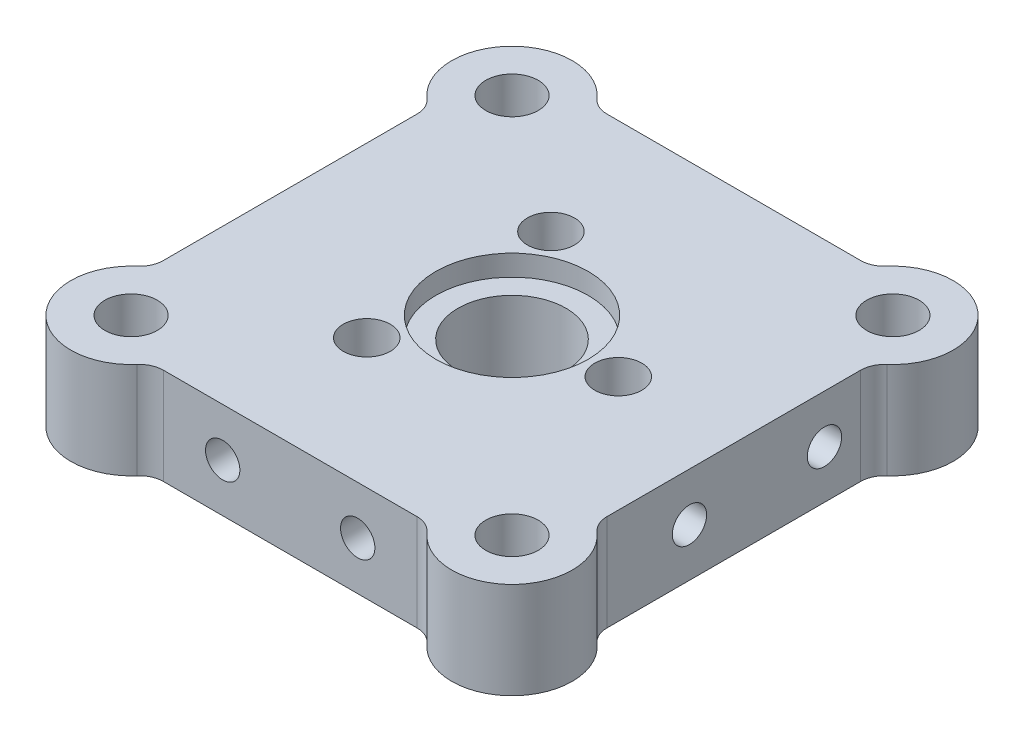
from build123d import *
from build123d.topology import SkipClean

# Parameters (mm, degrees)
SKETCH1_W                        = 33.02
SKETCH1_H                        = 33.02
EXTRUDE1_DEPTH                   = 6.35
SKETCH3_R                        = 5.0165
CUT_EXTRUDE2_DEPTH               = 1.3716
CUT_EXTRUDE3_REACH               = 25.874
SKETCH4_R                        = 3.556
FILLET1_R                        = 3.96875
CUT_EXTRUDE4_DEPTH               = 25.196749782
CBORE_FOR_M2_5_SHCS1_D           = 3.1
CBORE_FOR_M2_5_SHCS1_CBORE_D     = 5.5
CBORE_FOR_M2_5_SHCS1_CBORE_DEPTH = 3.516
F_4_40_TAPPED_HOLE1_D            = 2.2606
F_4_40_TAPPED_HOLE1_DEPTH        = 7.5946
F_4_40_TAPPED_HOLE1_TIP          = 0.679152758
F_4_40_TAPPED_HOLE2_D            = 2.2606
F_4_40_TAPPED_HOLE2_DEPTH        = 7.5946
F_4_40_TAPPED_HOLE2_TIP          = 0.679152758
F_8_32_TAPPED_HOLE1_D            = 3.4544
F_4_40_TAPPED_HOLE3_D            = 2.2606
F_4_40_TAPPED_HOLE3_DEPTH        = 7.5946
F_4_40_TAPPED_HOLE3_TIP          = 0.679152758
F_4_40_TAPPED_HOLE4_D            = 2.2606
F_4_40_TAPPED_HOLE4_DEPTH        = 7.5946
F_4_40_TAPPED_HOLE4_TIP          = 0.679152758


with BuildPart() as part:
    # Sketch1 → Extrude1 (new body)
    with BuildSketch(Plane(origin=(0, 0, 0), x_dir=(0, 0, -1), z_dir=(0, 1, 0))):
        Rectangle(SKETCH1_W, SKETCH1_H)
    extrude(amount=EXTRUDE1_DEPTH)

    # Sketch3 → Cut-Extrude2 (cut)
    with BuildSketch(Plane(origin=(0, 6.35, 0), x_dir=(1, 0, 0), z_dir=(0, 1, 0))):
        with Locations(Location((0, 0, 0), (0, 0, 270))):
            Circle(SKETCH3_R)
    extrude(amount=-CUT_EXTRUDE2_DEPTH, mode=Mode.SUBTRACT)

    # Sketch4 → Cut-Extrude3 (cut, up to next)
    with BuildSketch(Plane(origin=(0, 4.9784, 0), x_dir=(1, 0, 0), z_dir=(0, 1, 0)), mode=Mode.PRIVATE) as cut_extrude3_sk1:
        with Locations(Location((0, 0, 0), (0, 0, 180))):
            Circle(SKETCH4_R)
    cut_extrude3_tool1 = extrude(cut_extrude3_sk1.sketch, amount=-CUT_EXTRUDE3_REACH, mode=Mode.PRIVATE) & part.part
    add(cut_extrude3_tool1.solids().sort_by_distance((0, 4.9784, 0))[0], mode=Mode.SUBTRACT)

    # Fillet1
    fillet1_edges = [part.edges().sort_by_distance(p)[0] for p in [
        (16.51, 3.175, -16.51),
        (16.51, 3.175, 16.51),
        (-16.51, 3.175, 16.51),
        (-16.51, 3.175, -16.51),
    ]]
    fillet(fillet1_edges, radius=FILLET1_R)

    # Sketch21 → Cut-Extrude4 (cut, through all)
    with SkipClean():  # the faces are left unmerged after this step: merging them gives an invalid solid
        with BuildSketch(Plane(origin=(0, 6.35, 0), x_dir=(1, 0, 0), z_dir=(0, 1, 0))):
            with BuildLine():
                Line((16.51, -12.54125), (16.51, 12.54125))
                ThreePointArc((16.51, 12.54125), (16.153840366, 10.898031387), (15.149285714, 9.54974097))
                ThreePointArc((15.149285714, 9.54974097), (14.747463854, 9.010424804), (14.605, 8.353137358))
                Line((14.605, 8.353137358), (14.605, -8.353137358))
                ThreePointArc((14.605, -8.353137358), (14.747463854, -9.010424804), (15.149285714, -9.54974097))
                ThreePointArc((15.149285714, -9.54974097), (16.153840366, -10.898031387), (16.51, -12.54125))
            make_face()
            with BuildLine():
                Line((12.54125, 16.51), (-12.54125, 16.51))
                ThreePointArc((-12.54125, 16.51), (-10.898031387, 16.153840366), (-9.54974097, 15.149285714))
                ThreePointArc((-9.54974097, 15.149285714), (-9.010424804, 14.747463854), (-8.353137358, 14.605))
                Line((-8.353137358, 14.605), (8.353137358, 14.605))
                ThreePointArc((8.353137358, 14.605), (9.010424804, 14.747463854), (9.54974097, 15.149285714))
                ThreePointArc((9.54974097, 15.149285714), (10.898031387, 16.153840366), (12.54125, 16.51))
            make_face()
            with BuildLine():
                Line((-16.51, 12.54125), (-16.51, -12.54125))
                ThreePointArc((-16.51, -12.54125), (-16.153840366, -10.898031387), (-15.149285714, -9.54974097))
                ThreePointArc((-15.149285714, -9.54974097), (-14.747463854, -9.010424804), (-14.605, -8.353137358))
                Line((-14.605, -8.353137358), (-14.605, 8.353137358))
                ThreePointArc((-14.605, 8.353137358), (-14.747463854, 9.010424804), (-15.149285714, 9.54974097))
                ThreePointArc((-15.149285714, 9.54974097), (-16.153840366, 10.898031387), (-16.51, 12.54125))
            make_face()
            with BuildLine():
                Line((-12.54125, -16.51), (12.54125, -16.51))
                ThreePointArc((12.54125, -16.51), (10.898031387, -16.153840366), (9.54974097, -15.149285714))
                ThreePointArc((9.54974097, -15.149285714), (9.010424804, -14.747463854), (8.353137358, -14.605))
                Line((8.353137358, -14.605), (-8.353137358, -14.605))
                ThreePointArc((-8.353137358, -14.605), (-9.010424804, -14.747463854), (-9.54974097, -15.149285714))
                ThreePointArc((-9.54974097, -15.149285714), (-10.898031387, -16.153840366), (-12.54125, -16.51))
            make_face()
        extrude(amount=-CUT_EXTRUDE4_DEPTH, mode=Mode.SUBTRACT)

    # CBORE for M2.5 SHCS1 (through all)
    with Locations(Plane(origin=(3.175, 0, 0), x_dir=(-1, 0, 0), z_dir=(0, -1, 0))):
        with Locations((-3.825, 0), (6.675, -6.062177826), (6.675, 6.062177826)):
            CounterBoreHole(CBORE_FOR_M2_5_SHCS1_D / 2, CBORE_FOR_M2_5_SHCS1_CBORE_D / 2, CBORE_FOR_M2_5_SHCS1_CBORE_DEPTH)

    # 4-40 Tapped Hole1
    with Locations(Plane(origin=(-14.605, 0, 0), x_dir=(0, 0, -1), z_dir=(-1, 0, 0))):
        with Locations((-4.445, -3.175), (4.445, -3.175)):
            Hole(F_4_40_TAPPED_HOLE1_D / 2, depth=F_4_40_TAPPED_HOLE1_DEPTH)
            with Locations((0, 0, -(F_4_40_TAPPED_HOLE1_DEPTH + F_4_40_TAPPED_HOLE1_TIP / 2))):  # 118° drill point
                Cone(0, F_4_40_TAPPED_HOLE1_D / 2, F_4_40_TAPPED_HOLE1_TIP, mode=Mode.SUBTRACT)

    # 4-40 Tapped Hole2
    with Locations(Plane(origin=(0, 0, 14.605), x_dir=(-1, 0, 0), z_dir=(0, 0, 1))):
        with Locations((4.445, -3.175), (-4.445, -3.175)):
            Hole(F_4_40_TAPPED_HOLE2_D / 2, depth=F_4_40_TAPPED_HOLE2_DEPTH)
            with Locations((0, 0, -(F_4_40_TAPPED_HOLE2_DEPTH + F_4_40_TAPPED_HOLE2_TIP / 2))):  # 118° drill point
                Cone(0, F_4_40_TAPPED_HOLE2_D / 2, F_4_40_TAPPED_HOLE2_TIP, mode=Mode.SUBTRACT)

    # 8-32 Tapped Hole1 (through all)
    with Locations(Plane(origin=(0, 6.35, 0), x_dir=(1, 0, 0), z_dir=(0, 1, 0))):
        with Locations((12.54125, 12.54125), (-12.54125, 12.54125), (12.54125, -12.54125), (-12.54125, -12.54125)):
            Hole(F_8_32_TAPPED_HOLE1_D / 2)

    # 4-40 Tapped Hole3
    with Locations(Plane(origin=(0, 0, -14.605), x_dir=(-1, 0, 0), z_dir=(0, 0, -1))):
        with Locations((-5.207, 3.175), (3.683, 3.175)):
            Hole(F_4_40_TAPPED_HOLE3_D / 2, depth=F_4_40_TAPPED_HOLE3_DEPTH)
            with Locations((0, 0, -(F_4_40_TAPPED_HOLE3_DEPTH + F_4_40_TAPPED_HOLE3_TIP / 2))):  # 118° drill point
                Cone(0, F_4_40_TAPPED_HOLE3_D / 2, F_4_40_TAPPED_HOLE3_TIP, mode=Mode.SUBTRACT)

    # 4-40 Tapped Hole4
    with Locations(Plane(origin=(14.605, 0, 0), x_dir=(0, 0, -1), z_dir=(1, 0, 0))):
        with Locations((5.969, 3.175), (-2.921, 3.175)):
            Hole(F_4_40_TAPPED_HOLE4_D / 2, depth=F_4_40_TAPPED_HOLE4_DEPTH)
            with Locations((0, 0, -(F_4_40_TAPPED_HOLE4_DEPTH + F_4_40_TAPPED_HOLE4_TIP / 2))):  # 118° drill point
                Cone(0, F_4_40_TAPPED_HOLE4_D / 2, F_4_40_TAPPED_HOLE4_TIP, mode=Mode.SUBTRACT)


solid = part.part
